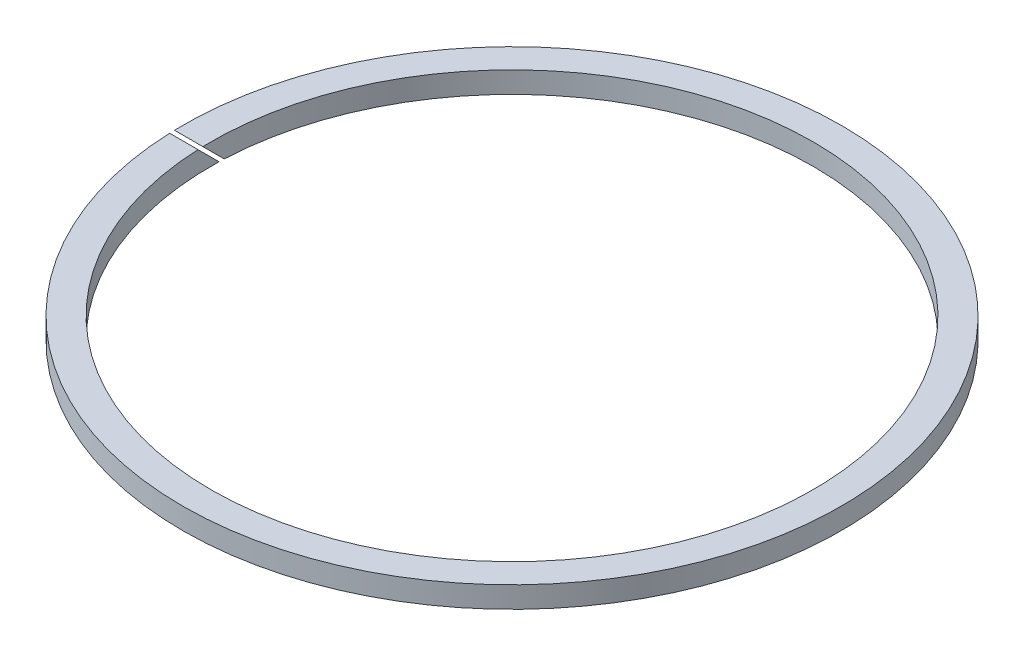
from build123d import *

# Parameters (mm, degrees)
SKETCH1_R          = 46.5
SKETCH1_R_2        = 42.5
EXTRUDE1_DEPTH     = 1.5
CUT_EXTRUDE1_DEPTH = 66.778035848


with BuildPart() as part:
    # Sketch1 → Extrude1 (new, symmetric)
    with BuildSketch(Plane(origin=(0, 0, 0), x_dir=(1, 0, 0), z_dir=(0, 1, 0))):
        Circle(SKETCH1_R)
        Circle(SKETCH1_R_2, mode=Mode.SUBTRACT)
    extrude(amount=EXTRUDE1_DEPTH, both=True)

    # Sketch2 → Cut-Extrude1 (cut, through all)
    with BuildSketch(Plane(origin=(0, 0, 0), x_dir=(0, 0, -1), z_dir=(1, 0, 0))):
        Polygon((-1.853553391, 1.5), (1.146446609, -1.5), (1.853553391, -1.5), (-1.146446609, 1.5), align=None)
    extrude(amount=-CUT_EXTRUDE1_DEPTH, mode=Mode.SUBTRACT)


solid = part.part
